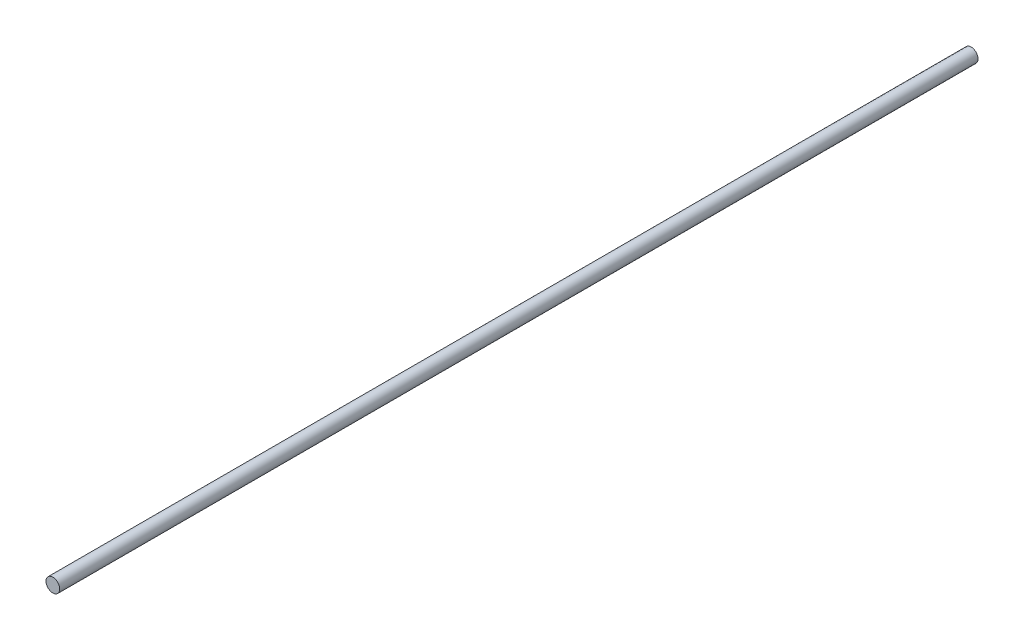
from build123d import *

# Parameters (mm, degrees)
CROQUIS1_R              = 1.25
SALIENTE_EXTRUIR1_DEPTH = 167


with BuildPart() as part:
    # Croquis1 → Saliente-Extruir1 (new body)
    with BuildSketch(Plane.XY):
        with Locations(Location((0, 0, 0), (0, 0, 180))):
            Circle(CROQUIS1_R)
    extrude(amount=SALIENTE_EXTRUIR1_DEPTH)


solid = part.part
